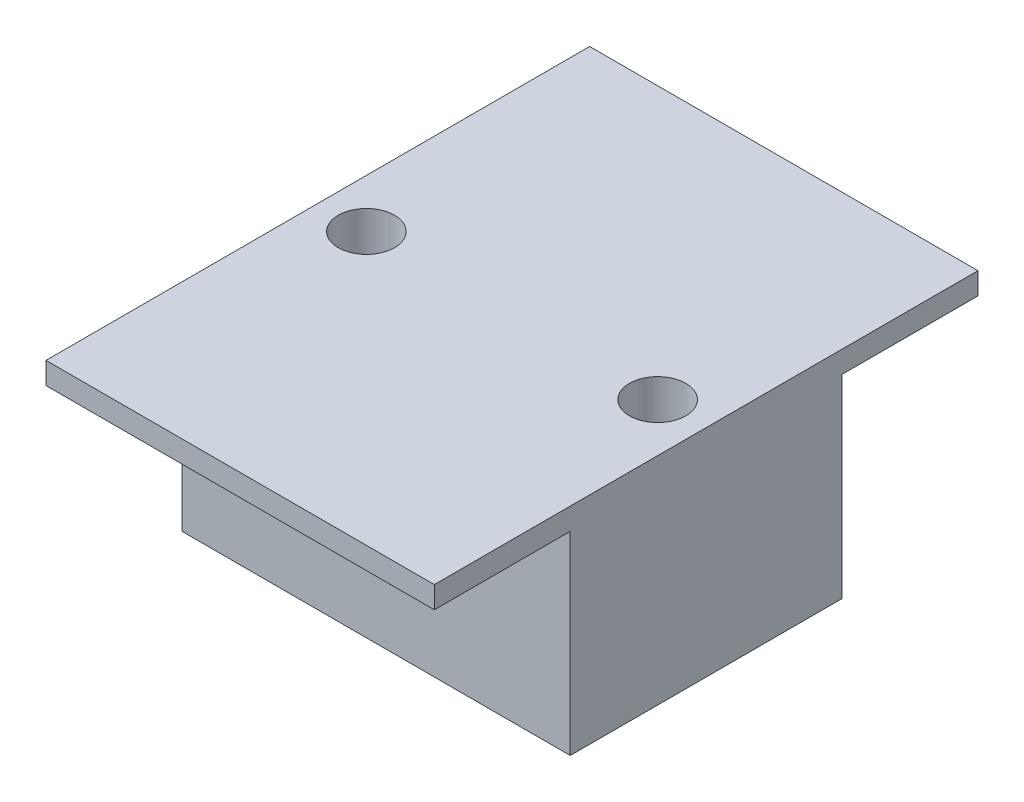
from build123d import *

# Parameters (mm, degrees)
SKETCH1_W           = 20
SKETCH1_H           = 28
BOSS_EXTRUDE1_DEPTH = 1.125
SKETCH1_3_W         = 20
SKETCH1_3_H         = 14
BOSS_EXTRUDE2_DEPTH = 10
CUT_EXTRUDE1_DEPTH  = 21.488182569


with BuildPart() as part:
    # Sketch1 → Boss-Extrude1 (new body)
    with BuildSketch(Plane(origin=(0, 0, 0), x_dir=(1, 0, 0), z_dir=(0, 1, 0))):
        Rectangle(SKETCH1_W, SKETCH1_H)
    extrude(amount=BOSS_EXTRUDE1_DEPTH)

    # Sketch1_3 → Boss-Extrude2 (add)
    with BuildSketch(Plane(origin=(0, 0, 0), x_dir=(1, 0, 0), z_dir=(0, 1, 0))):
        Rectangle(SKETCH1_3_W, SKETCH1_3_H)
    extrude(amount=-BOSS_EXTRUDE2_DEPTH)

    # Sketch2 → Cut-Extrude1 (cut, through all)
    with BuildSketch(Plane.XZ.offset(10)):
        with BuildLine():
            ThreePointArc((-8.95, 0), (-7.5, -1.45), (-6.05, 0))
            Line((-6.05, 0), (-8.95, 0))
        make_face()
        with BuildLine():
            Line((-8.95, 0), (-6.05, 0))
            ThreePointArc((-6.05, 0), (-7.5, 1.45), (-8.95, 0))
        make_face()
        with BuildLine():
            ThreePointArc((-8.95, 0), (-7.5, -1.45), (-6.05, 0))
            Line((-6.05, 0), (-8.95, 0))
        make_face()
        with BuildLine():
            Line((-8.95, 0), (-6.05, 0))
            ThreePointArc((-6.05, 0), (-7.5, 1.45), (-8.95, 0))
        make_face()
        with BuildLine():
            ThreePointArc((6.05, 0), (7.5, -1.45), (8.95, 0))
            Line((8.95, 0), (6.05, 0))
        make_face()
        with BuildLine():
            Line((6.05, 0), (8.95, 0))
            ThreePointArc((8.95, 0), (7.5, 1.45), (6.05, 0))
        make_face()
        with BuildLine():
            ThreePointArc((6.05, 0), (7.5, -1.45), (8.95, 0))
            Line((8.95, 0), (6.05, 0))
        make_face()
        with BuildLine():
            Line((6.05, 0), (8.95, 0))
            ThreePointArc((8.95, 0), (7.5, 1.45), (6.05, 0))
        make_face()
    extrude(amount=-CUT_EXTRUDE1_DEPTH, mode=Mode.SUBTRACT)


solid = part.part
